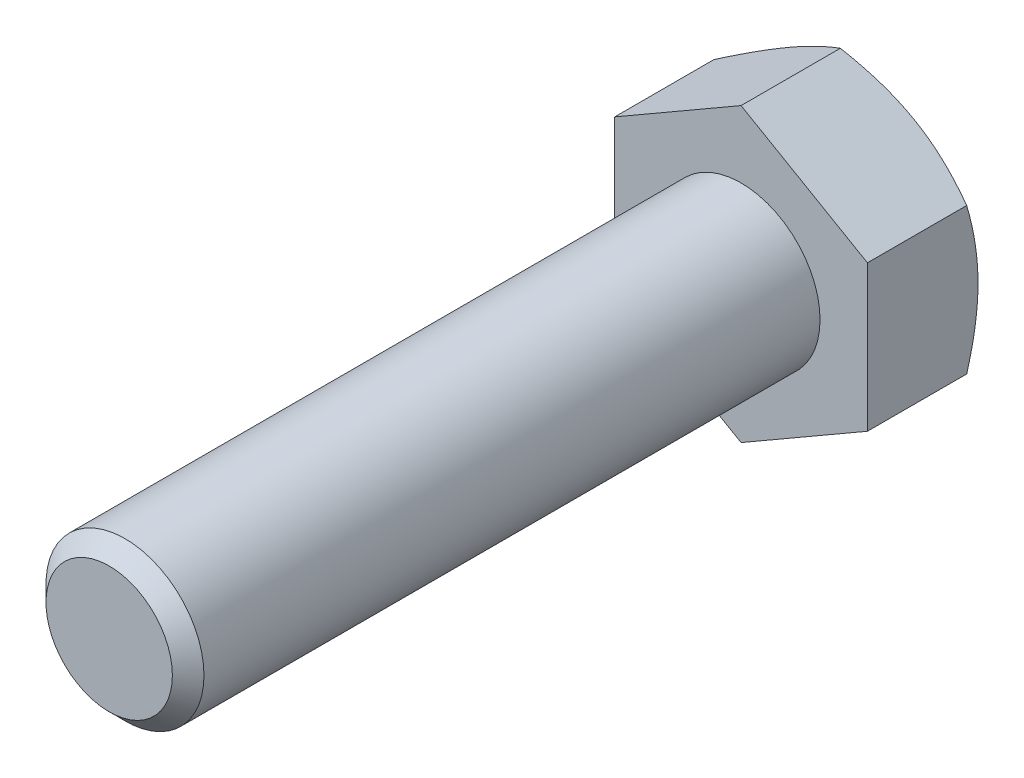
from build123d import *

# Parameters (mm, degrees)
ESQUISSE1_W        = 2.5
ESQUISSE1_H        = 20
CHANFREIN1_SIZE    = 0.5
BOSS_EXTRU_1_DEPTH = 3.5


with BuildPart() as part:
    # Esquisse1 → Base-R_volution (revolve)
    with BuildSketch(Plane(origin=(0, 0, 0), x_dir=(1, 0, 0), z_dir=(0, 1, 0))):
        with Locations((1.25, -10)):
            Rectangle(ESQUISSE1_W, ESQUISSE1_H)
    revolve(axis=Axis((0, 0, 0), (0, 0, 1)))

    # Chanfrein1
    chanfrein1_edges = [part.edges().sort_by_distance(p)[0] for p in [
        (-2.5, 0, 20),
    ]]
    chamfer(chanfrein1_edges, length=CHANFREIN1_SIZE)

    # Esquisse6 → Boss.-Extru.1 (add)
    with BuildSketch(Plane.XY):
        Polygon((4, -2.309401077), (4, 2.309401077), (0, 4.618802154), (-4, 2.309401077), (-4, -2.309401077), (0, -4.618802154), align=None)
    extrude(amount=-BOSS_EXTRU_1_DEPTH)

    # Esquisse7 → Enl_vement de mati_re-R_volution1 (revolve, cut)
    with BuildSketch(Plane(origin=(0, 0, 0), x_dir=(1, 0, 0), z_dir=(0, 1, 0))):
        Polygon((-4, 3.5), (-10.062177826, 3.5), (-10.062177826, 0), align=None)
    revolve(axis=Axis((0, 0, -6.239446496), (0, 0, 1)), mode=Mode.SUBTRACT)


solid = part.part
